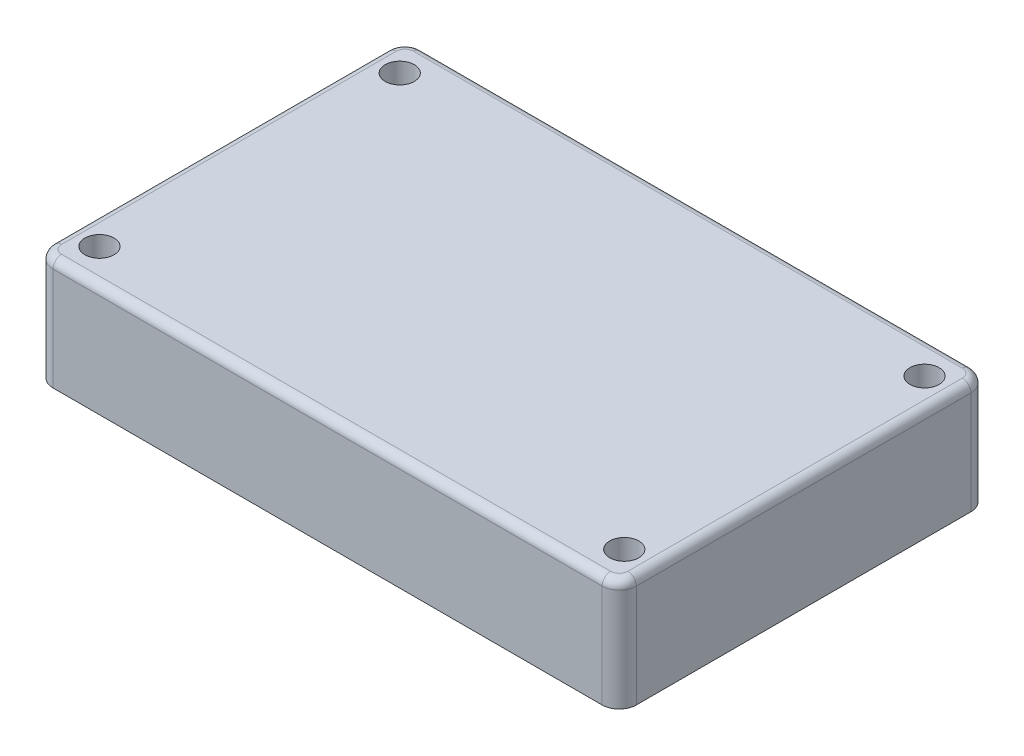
from build123d import *
from OCP.BRepFilletAPI import BRepFilletAPI_MakeChamfer

# Parameters (mm, degrees)
BOSS_EXTRUDE1_START       = 1.6
SKETCH1_W                 = 68
SKETCH1_H                 = 43
BOSS_EXTRUDE1_DEPTH       = 13
SHELL1_T                  = -4
SHELL1_THICKNESS_2_FACE_W = 35
SHELL1_THICKNESS_2_FACE_H = 60
SHELL1_THICKNESS_2_DEPTH  = 1.6
CHAMFER2_SIZE             = 2
CHAMFER2_SIZE2            = 7.464101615
BOSS_EXTRUDE2_DEPTH       = 10.6
FILLET3_R                 = 2
FILLET4_R                 = 2
M3_CLEARANCE_HOLE1_D      = 3.4
FILLET5_R                 = 1


with BuildPart() as part:
    # Sketch1 → Boss-Extrude1 (new body)
    with BuildSketch(Plane(origin=(0, 0, 0), x_dir=(1, 0, 0), z_dir=(0, 1, 0)).offset(BOSS_EXTRUDE1_START)):
        Rectangle(SKETCH1_W, SKETCH1_H)
    extrude(amount=BOSS_EXTRUDE1_DEPTH)

    # Shell1
    shell1_openings = [part.faces().sort_by_distance(p)[0] for p in [
        (0, 1.6, 0),
    ]]
    offset(amount=SHELL1_T, openings=shell1_openings, kind=Kind.INTERSECTION)

    # Shell1 thickness 2 face (on inner face of the shell) → Shell1 thickness 2 (cut)
    with BuildSketch(Plane.ZX.offset(10.6)):
        Rectangle(SHELL1_THICKNESS_2_FACE_W, SHELL1_THICKNESS_2_FACE_H)
    extrude(amount=SHELL1_THICKNESS_2_DEPTH, mode=Mode.SUBTRACT)

    # Chamfer2: one chamfer whose edges measure the first distance from different faces: ONE call of the kernel's chamfer builder (chamfer() names one face for all edges)
    chamfer2_edges_1 = [part.edges().sort_by_distance(p)[0] for p in [
        (-30, 6.9, 17.5),
        (30, 6.9, 17.5),
    ]]
    chamfer2_side_1 = [part.faces().sort_by_distance(p)[0] for p in [
        (0, 6.9, 17.5),
    ]]
    chamfer2_edges_2 = [part.edges().sort_by_distance(p)[0] for p in [
        (30, 6.9, -17.5),
        (-30, 6.9, -17.5),
    ]]
    chamfer2_side_2 = [part.faces().sort_by_distance(p)[0] for p in [
        (0, 6.9, -17.5),
    ]]
    chamfer2 = BRepFilletAPI_MakeChamfer(part.part.solid().wrapped)
    for e in chamfer2_edges_1:
        chamfer2.Add(CHAMFER2_SIZE, CHAMFER2_SIZE2, e.wrapped, chamfer2_side_1[0].wrapped)  # the first distance lies on this face
    for e in chamfer2_edges_2:
        chamfer2.Add(CHAMFER2_SIZE, CHAMFER2_SIZE2, e.wrapped, chamfer2_side_2[0].wrapped)  # the first distance lies on this face
    add(Compound.cast(chamfer2.Shape()), mode=Mode.REPLACE)

    # Sketch5 → Boss-Extrude2 (add)
    with BuildSketch(Plane.XZ.offset(-1.6)):
        with BuildLine():
            Line((34, 2), (34, -2))
            ThreePointArc((34, -2), (31, -5), (28, -2))
            Line((28, -2), (28, 2))
            ThreePointArc((28, 2), (31, 5), (34, 2))
        make_face()
    extrude(amount=-BOSS_EXTRUDE2_DEPTH)

    # Fillet3
    fillet3_edges = [part.edges().sort_by_distance(p)[0] for p in [
        (-30, 6.9, -10.035898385),
        (-30, 6.9, 10.035898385),
        (28, 6.9, 17.5),
        (-28, 6.9, 17.5),
        (28, 6.9, -17.5),
        (-28, 6.9, -17.5),
        (30, 6.9, 10.035898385),
        (30, 6.9, -10.035898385),
        (30, 6.9, 4.828427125),
        (30, 6.9, -4.828427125),
    ]]
    fillet(fillet3_edges, radius=FILLET3_R)

    # Fillet4
    fillet4_edges = [part.edges().sort_by_distance(p)[0] for p in [
        (34, 8.1, 21.5),
        (34, 8.1, -21.5),
        (-34, 8.1, -21.5),
        (-34, 8.1, 21.5),
    ]]
    fillet(fillet4_edges, radius=FILLET4_R)

    # M3 Clearance Hole1 (through all)
    with Locations(Plane(origin=(0, 14.6, 0), x_dir=(1, 0, 0), z_dir=(0, 1, 0))):
        with Locations((30.588511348, 17.5), (-30.588511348, 17.5), (30.588511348, -17.5), (-30.588511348, -17.5)):
            Hole(M3_CLEARANCE_HOLE1_D / 2)

    # Cut-Sweep1: sweep along a path in Sketch9
    with BuildLine(Plane.XY) as cut_sweep1_path:
        Line((31, 1.6), (27, 8.52820323))
    # Sketch6 → Cut-Sweep1 (sweep, cut)
    with BuildSketch(Plane.XZ.offset(-1.6)):
        with BuildLine():
            Line((30, -2), (30, 2))
            ThreePointArc((30, 2), (31, 3), (32, 2))
            Line((32, 2), (32, -2))
            ThreePointArc((32, -2), (31, -3), (30, -2))
        make_face()
    sweep(path=cut_sweep1_path.line, mode=Mode.SUBTRACT)

    # Fillet5
    fillet5_edges = [part.edges().sort_by_distance(p)[0] for p in [
        (-34, 14.6, 0),
        (0, 14.6, -21.5),
        (0, 14.6, 21.5),
        (34, 14.6, 0),
        (33.414213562, 14.6, 20.914213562),
        (33.414213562, 14.6, -20.914213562),
        (-33.414213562, 14.6, 20.914213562),
        (-33.414213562, 14.6, -20.914213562),
    ]]
    fillet(fillet5_edges, radius=FILLET5_R)


solid = part.part
